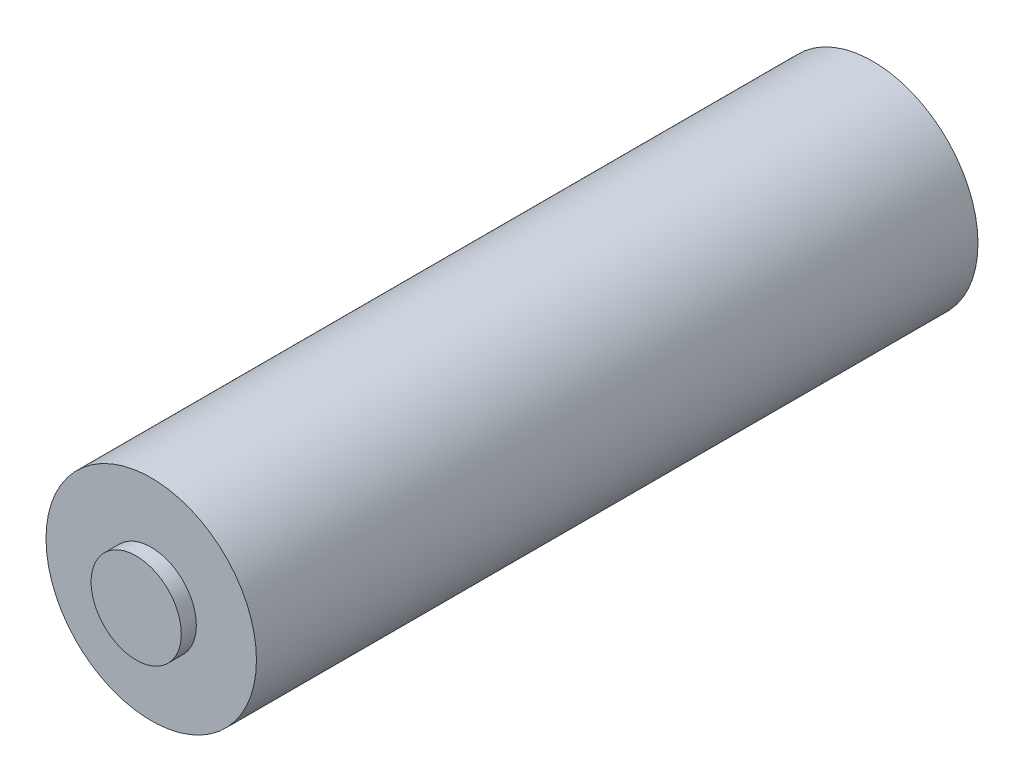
ISO-10303-21;
HEADER;
FILE_DESCRIPTION(('STEP AP214'),'2;1');
FILE_NAME('part.step','',(''),(''),'','','');
FILE_SCHEMA(('AUTOMOTIVE_DESIGN { 1 0 10303 214 1 1 1 1 }'));
ENDSEC;
DATA;
#1=APPLICATION_CONTEXT('core data for automotive mechanical design processes');
#2=APPLICATION_PROTOCOL_DEFINITION('international standard','automotive_design',2000,#1);
#3=PRODUCT_CONTEXT('',#1,'mechanical');
#4=PRODUCT('Part','Part','',(#3));
#5=PRODUCT_RELATED_PRODUCT_CATEGORY('part','',(#4));
#6=PRODUCT_DEFINITION_FORMATION('','',#4);
#7=PRODUCT_DEFINITION_CONTEXT('part definition',#1,'design');
#8=PRODUCT_DEFINITION('design','',#6,#7);
#9=PRODUCT_DEFINITION_SHAPE('','',#8);
#10=(LENGTH_UNIT() NAMED_UNIT(*) SI_UNIT(.MILLI.,.METRE.));
#11=(NAMED_UNIT(*) PLANE_ANGLE_UNIT() SI_UNIT($,.RADIAN.));
#12=(NAMED_UNIT(*) SI_UNIT($,.STERADIAN.) SOLID_ANGLE_UNIT());
#13=UNCERTAINTY_MEASURE_WITH_UNIT(LENGTH_MEASURE(1.E-05),#10,'distance_accuracy_value','');
#14=(GEOMETRIC_REPRESENTATION_CONTEXT(3) GLOBAL_UNCERTAINTY_ASSIGNED_CONTEXT((#13)) GLOBAL_UNIT_ASSIGNED_CONTEXT((#10,
#11,#12)) REPRESENTATION_CONTEXT('',''));
#15=CARTESIAN_POINT('',(0.,0.,0.));
#16=DIRECTION('',(0.,0.,1.));
#17=DIRECTION('',(1.,0.,0.));
#18=AXIS2_PLACEMENT_3D('',#15,#16,#17);
#19=CARTESIAN_POINT('',(0.,0.,48.));
#20=DIRECTION('',(0.,0.,1.));
#21=DIRECTION('',(1.,0.,0.));
#22=AXIS2_PLACEMENT_3D('',#19,#20,#21);
#23=PLANE('',#22);
#24=CARTESIAN_POINT('',(0.,0.,48.));
#25=DIRECTION('',(0.,0.,1.));
#26=DIRECTION('',(1.,0.,0.));
#27=AXIS2_PLACEMENT_3D('',#24,#25,#26);
#28=CIRCLE('',#27,7.);
#29=CARTESIAN_POINT('',(7.,0.,48.));
#30=VERTEX_POINT('',#29);
#31=EDGE_CURVE('E10',#30,#30,#28,.T.);
#32=ORIENTED_EDGE('',*,*,#31,.T.);
#33=EDGE_LOOP('',(#32));
#34=FACE_BOUND('',#33,.T.);
#35=CARTESIAN_POINT('',(0.,0.,48.));
#36=DIRECTION('',(0.,0.,1.));
#37=DIRECTION('',(1.,0.,0.));
#38=AXIS2_PLACEMENT_3D('',#35,#36,#37);
#39=CIRCLE('',#38,3.);
#40=CARTESIAN_POINT('',(3.,0.,48.));
#41=VERTEX_POINT('',#40);
#42=EDGE_CURVE('E46',#41,#41,#39,.T.);
#43=ORIENTED_EDGE('',*,*,#42,.F.);
#44=EDGE_LOOP('',(#43));
#45=FACE_BOUND('',#44,.T.);
#46=ADVANCED_FACE('F31',(#34,#45),#23,.T.);
#47=CARTESIAN_POINT('',(0.,0.,48.));
#48=DIRECTION('',(0.,0.,-1.));
#49=DIRECTION('',(-1.,0.,0.));
#50=AXIS2_PLACEMENT_3D('',#47,#48,#49);
#51=CYLINDRICAL_SURFACE('',#50,7.);
#52=ORIENTED_EDGE('',*,*,#31,.F.);
#53=EDGE_LOOP('',(#52));
#54=FACE_BOUND('',#53,.T.);
#55=CARTESIAN_POINT('',(0.,0.,0.));
#56=DIRECTION('',(0.,0.,1.));
#57=DIRECTION('',(1.,0.,0.));
#58=AXIS2_PLACEMENT_3D('',#55,#56,#57);
#59=CIRCLE('',#58,7.);
#60=CARTESIAN_POINT('',(7.,0.,0.));
#61=VERTEX_POINT('',#60);
#62=EDGE_CURVE('E38',#61,#61,#59,.T.);
#63=ORIENTED_EDGE('',*,*,#62,.T.);
#64=EDGE_LOOP('',(#63));
#65=FACE_BOUND('',#64,.T.);
#66=ADVANCED_FACE('F33',(#54,#65),#51,.T.);
#67=CARTESIAN_POINT('',(0.,0.,0.));
#68=DIRECTION('',(0.,0.,1.));
#69=DIRECTION('',(1.,0.,0.));
#70=AXIS2_PLACEMENT_3D('',#67,#68,#69);
#71=PLANE('',#70);
#72=ORIENTED_EDGE('',*,*,#62,.F.);
#73=EDGE_LOOP('',(#72));
#74=FACE_BOUND('',#73,.T.);
#75=ADVANCED_FACE('F58',(#74),#71,.F.);
#76=CARTESIAN_POINT('',(0.,0.,49.));
#77=DIRECTION('',(0.,0.,-1.));
#78=DIRECTION('',(-1.,0.,0.));
#79=AXIS2_PLACEMENT_3D('',#76,#77,#78);
#80=CYLINDRICAL_SURFACE('',#79,3.);
#81=CARTESIAN_POINT('',(0.,0.,49.));
#82=DIRECTION('',(0.,0.,1.));
#83=DIRECTION('',(1.,0.,0.));
#84=AXIS2_PLACEMENT_3D('',#81,#82,#83);
#85=CIRCLE('',#84,3.);
#86=CARTESIAN_POINT('',(3.,0.,49.));
#87=VERTEX_POINT('',#86);
#88=EDGE_CURVE('E42',#87,#87,#85,.T.);
#89=ORIENTED_EDGE('',*,*,#88,.F.);
#90=EDGE_LOOP('',(#89));
#91=FACE_BOUND('',#90,.T.);
#92=ORIENTED_EDGE('',*,*,#42,.T.);
#93=EDGE_LOOP('',(#92));
#94=FACE_BOUND('',#93,.T.);
#95=ADVANCED_FACE('F52',(#91,#94),#80,.T.);
#96=CARTESIAN_POINT('',(0.,0.,49.));
#97=DIRECTION('',(0.,0.,1.));
#98=DIRECTION('',(1.,0.,0.));
#99=AXIS2_PLACEMENT_3D('',#96,#97,#98);
#100=PLANE('',#99);
#101=ORIENTED_EDGE('',*,*,#88,.T.);
#102=EDGE_LOOP('',(#101));
#103=FACE_BOUND('',#102,.T.);
#104=ADVANCED_FACE('F66',(#103),#100,.T.);
#105=CLOSED_SHELL('',(#46,#66,#75,#95,#104));
#106=MANIFOLD_SOLID_BREP('B2',#105);
#107=ADVANCED_BREP_SHAPE_REPRESENTATION('',(#18,#106),#14);
#108=SHAPE_DEFINITION_REPRESENTATION(#9,#107);
ENDSEC;
END-ISO-10303-21;
